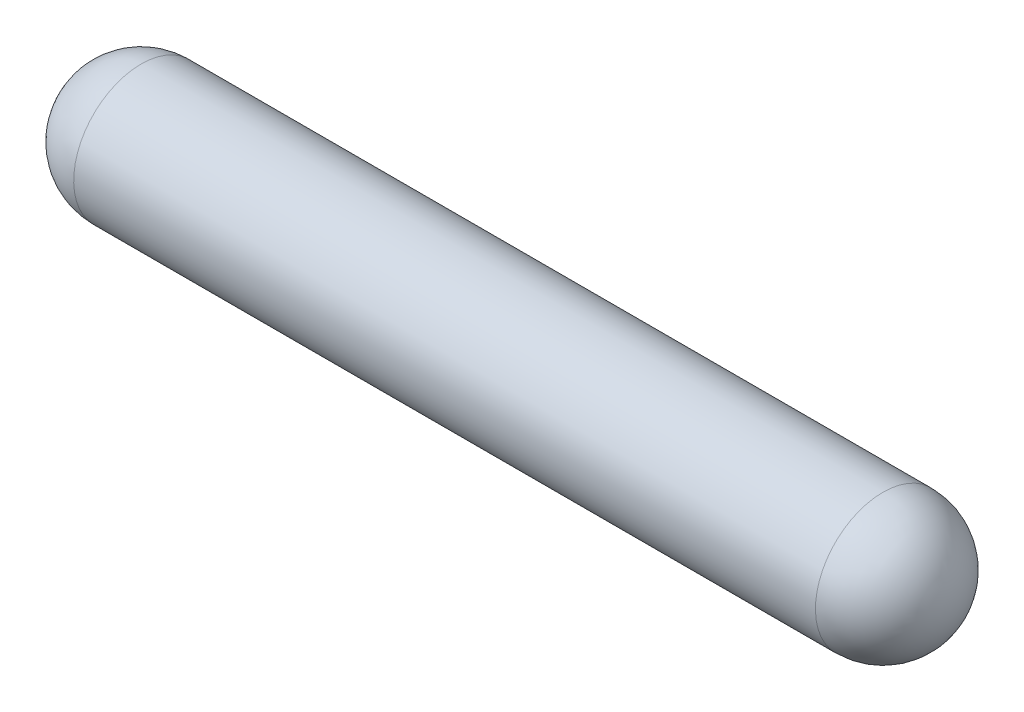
ISO-10303-21;
HEADER;
FILE_DESCRIPTION(('STEP AP214'),'2;1');
FILE_NAME('part.step','',(''),(''),'','','');
FILE_SCHEMA(('AUTOMOTIVE_DESIGN { 1 0 10303 214 1 1 1 1 }'));
ENDSEC;
DATA;
#1=APPLICATION_CONTEXT('core data for automotive mechanical design processes');
#2=APPLICATION_PROTOCOL_DEFINITION('international standard','automotive_design',2000,#1);
#3=PRODUCT_CONTEXT('',#1,'mechanical');
#4=PRODUCT('Part','Part','',(#3));
#5=PRODUCT_RELATED_PRODUCT_CATEGORY('part','',(#4));
#6=PRODUCT_DEFINITION_FORMATION('','',#4);
#7=PRODUCT_DEFINITION_CONTEXT('part definition',#1,'design');
#8=PRODUCT_DEFINITION('design','',#6,#7);
#9=PRODUCT_DEFINITION_SHAPE('','',#8);
#10=(LENGTH_UNIT() NAMED_UNIT(*) SI_UNIT(.MILLI.,.METRE.));
#11=(NAMED_UNIT(*) PLANE_ANGLE_UNIT() SI_UNIT($,.RADIAN.));
#12=(NAMED_UNIT(*) SI_UNIT($,.STERADIAN.) SOLID_ANGLE_UNIT());
#13=UNCERTAINTY_MEASURE_WITH_UNIT(LENGTH_MEASURE(1.E-05),#10,'distance_accuracy_value','');
#14=(GEOMETRIC_REPRESENTATION_CONTEXT(3) GLOBAL_UNCERTAINTY_ASSIGNED_CONTEXT((#13)) GLOBAL_UNIT_ASSIGNED_CONTEXT((#10,
#11,#12)) REPRESENTATION_CONTEXT('',''));
#15=CARTESIAN_POINT('',(0.,0.,0.));
#16=DIRECTION('',(0.,0.,1.));
#17=DIRECTION('',(1.,0.,0.));
#18=AXIS2_PLACEMENT_3D('',#15,#16,#17);
#19=CARTESIAN_POINT('',(-34.925,0.,0.));
#20=DIRECTION('',(0.,0.,1.));
#21=DIRECTION('',(1.,0.,0.));
#22=AXIS2_PLACEMENT_3D('',#19,#20,#21);
#23=SPHERICAL_SURFACE('',#22,3.175);
#24=CARTESIAN_POINT('',(-34.925,0.,0.));
#25=DIRECTION('',(1.,0.,0.));
#26=DIRECTION('',(0.,1.,0.));
#27=AXIS2_PLACEMENT_3D('',#24,#25,#26);
#28=SPHERICAL_SURFACE('',#27,3.175);
#29=CARTESIAN_POINT('',(-34.925,0.,0.));
#30=DIRECTION('',(1.,0.,0.));
#31=DIRECTION('',(0.,1.,0.));
#32=AXIS2_PLACEMENT_3D('',#29,#30,#31);
#33=CIRCLE('',#32,3.17500000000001);
#34=CARTESIAN_POINT('',(-34.925,3.175,0.));
#35=VERTEX_POINT('',#34);
#36=EDGE_CURVE('E38',#35,#35,#33,.T.);
#37=ORIENTED_EDGE('',*,*,#36,.F.);
#38=EDGE_LOOP('',(#37));
#39=FACE_BOUND('',#38,.T.);
#40=ADVANCED_FACE('F32',(#39),#28,.T.);
#41=CARTESIAN_POINT('',(0.,0.,0.));
#42=DIRECTION('',(0.,0.,1.));
#43=DIRECTION('',(1.,0.,0.));
#44=AXIS2_PLACEMENT_3D('',#41,#42,#43);
#45=SPHERICAL_SURFACE('',#44,3.175);
#46=CARTESIAN_POINT('',(0.,0.,0.));
#47=DIRECTION('',(1.,0.,0.));
#48=DIRECTION('',(0.,1.,0.));
#49=AXIS2_PLACEMENT_3D('',#46,#47,#48);
#50=SPHERICAL_SURFACE('',#49,3.175);
#51=CARTESIAN_POINT('',(0.,0.,0.));
#52=DIRECTION('',(1.,0.,0.));
#53=DIRECTION('',(0.,1.,0.));
#54=AXIS2_PLACEMENT_3D('',#51,#52,#53);
#55=CIRCLE('',#54,3.175);
#56=CARTESIAN_POINT('',(0.,3.175,0.));
#57=VERTEX_POINT('',#56);
#58=EDGE_CURVE('E10',#57,#57,#55,.T.);
#59=ORIENTED_EDGE('',*,*,#58,.T.);
#60=EDGE_LOOP('',(#59));
#61=FACE_BOUND('',#60,.T.);
#62=ADVANCED_FACE('F47',(#61),#50,.T.);
#63=CARTESIAN_POINT('',(0.,0.,0.));
#64=DIRECTION('',(1.,0.,0.));
#65=DIRECTION('',(0.,1.,0.));
#66=AXIS2_PLACEMENT_3D('',#63,#64,#65);
#67=CYLINDRICAL_SURFACE('',#66,3.175);
#68=ORIENTED_EDGE('',*,*,#58,.F.);
#69=EDGE_LOOP('',(#68));
#70=FACE_BOUND('',#69,.T.);
#71=ORIENTED_EDGE('',*,*,#36,.T.);
#72=EDGE_LOOP('',(#71));
#73=FACE_BOUND('',#72,.T.);
#74=ADVANCED_FACE('F44',(#70,#73),#67,.T.);
#75=CLOSED_SHELL('',(#40,#62,#74));
#76=MANIFOLD_SOLID_BREP('B2',#75);
#77=ADVANCED_BREP_SHAPE_REPRESENTATION('',(#18,#76),#14);
#78=SHAPE_DEFINITION_REPRESENTATION(#9,#77);
ENDSEC;
END-ISO-10303-21;
